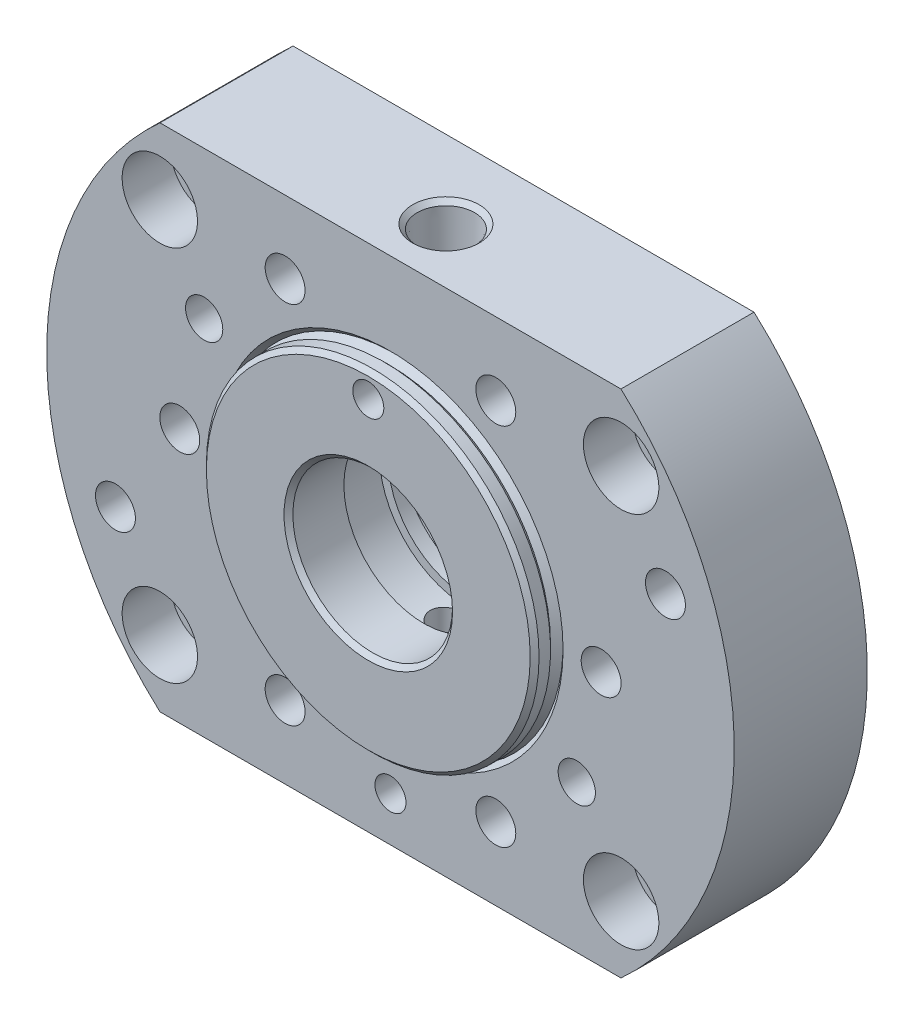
from build123d import *

# Parameters (mm, degrees)
SKETCH_2_W               = 5
SKETCH_2_H               = 57.081863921
CUT_EXTRUDE_1_DEPTH      = 1
SKETCH_3_W               = 162.907791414
SKETCH_3_H               = 39.12352471
CUT_EXTRUDE_3_DEPTH      = 116.05433499
CUT_EXTRUDE_4_REACH      = 104.652
CUT_EXTRUDE_4_END_RADIUS = 5
SKETCH_5_R               = 3.5
SKETCH_8_R               = 4.5
CUT_EXTRUDE_7_DEPTH      = 103.652325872
SKETCH_9_R               = 7
CUT_EXTRUDE_8_DEPTH      = 9
PATTERN_CIRCULAR_1_COUNT = 6
SKETCH_11_R              = 5.5
CUT_EXTRUDE_9_DEPTH      = 103.652325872
SKETCH_12_R              = 8.5
CUT_EXTRUDE_10_DEPTH     = 11
CHAMFER_1_SIZE           = 1
CHAMFER_2_SIZE           = 1
CHAMFER_2_SIZE2          = 1.032761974


with BuildPart() as part:
    # Sketch 1 → Revolve 1 (revolve)
    with BuildSketch(Plane(origin=(0, 0, 0), x_dir=(0, 0, -1), z_dir=(1, 0, 0)), mode=Mode.PRIVATE) as revolve_1_sk:
        Polygon((-1, 18), (-1, 35), (0, 35), (0, 77.5), (-30, 77.5), (-30, 38.914213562), (-28.939339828, 37.853553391), (-30.353553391, 36.439339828), (-31.414213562, 37.5), (-35, 37.5), (-35, 18), (-22.5, 18), (-22.5, 20), (-12.5, 20), (-12.5, 18), (-9.3, 18), (-9.3, 21), (-4.5, 21), (-4.5, 18), align=None)
    revolve(revolve_1_sk.sketch.rotate(Axis((0, 0, 0), (0, 0, 1)), 90), axis=Axis((0, 0, 0), (0, 0, 1)))

    # Sketch 2 → Cut-Extrude 1 (cut)
    with BuildSketch(Plane(origin=(0, 0, 0), x_dir=(-1, 0, 0), z_dir=(0, 0, -1))):
        with Locations((0, -56.280152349)):
            Rectangle(SKETCH_2_W, SKETCH_2_H)
    extrude(amount=-CUT_EXTRUDE_1_DEPTH, mode=Mode.SUBTRACT)

    # Sketch 3 → Cut-Extrude 3 (cut, through all)
    with BuildSketch(Plane.XY):
        with Locations((-14.591150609, 77.061762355)):
            Rectangle(SKETCH_3_W, SKETCH_3_H)
        with Locations((-14.591150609, -77.061762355)):
            Rectangle(SKETCH_3_W, SKETCH_3_H)
    extrude(amount=CUT_EXTRUDE_3_DEPTH, mode=Mode.SUBTRACT)

    # Sketch 4 → NPT1_4 (revolve, cut)
    with BuildSketch(Plane(origin=(0, 0, 0), x_dir=(0, 0, -1), z_dir=(1, 0, 0)), mode=Mode.PRIVATE) as npt1_4_sk:
        Polygon((-12.5, 25.5), (-12.5, 42.5), (-11.46875, 42.5), (-11, 57.5), (-17.5, 57.5), (-17.5, -47.5), (-14, -47.5), (-14, 24.633974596), align=None)
    revolve(npt1_4_sk.sketch.rotate(Axis((0, 70.558895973, 17.5), (0, -1, 0)), 180), axis=Axis((0, 70.558895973, 17.5), (0, -1, 0)), mode=Mode.SUBTRACT)

    # Cut-Extrude 4: up to this cylinder (the profile starts outside it)
    cut_extrude_4_end = Plane(origin=(0, 32, 17.5), z_dir=(0, 1, 0)) * Cylinder(CUT_EXTRUDE_4_END_RADIUS, 220.304, mode=Mode.PRIVATE)
    # Sketch 5 → Cut-Extrude 4 (cut, up to the surface)
    with BuildSketch(Plane.XY.offset(35), mode=Mode.PRIVATE) as cut_extrude_4_sk1:
        with Locations((0, 32)):
            Circle(SKETCH_5_R)
    cut_extrude_4_tool1 = extrude(cut_extrude_4_sk1.sketch, amount=-CUT_EXTRUDE_4_REACH, mode=Mode.PRIVATE) - cut_extrude_4_end
    add(cut_extrude_4_tool1.solids().sort_by_distance((0, 32, 35))[0], mode=Mode.SUBTRACT)

    # Sketch 8 → Cut-Extrude 7 (cut, through all)
    with BuildSketch(Plane(origin=(0, 0, 0), x_dir=(-1, 0, 0), z_dir=(0, 0, -1))):
        with Locations((-47.5, 0)):
            Circle(SKETCH_8_R)
    cut_extrude_7 = extrude(amount=-CUT_EXTRUDE_7_DEPTH, mode=Mode.SUBTRACT)

    # Sketch 9 → Cut-Extrude 8 (cut)
    with BuildSketch(Plane.XY):
        with Locations((47.5, 0)):
            Circle(SKETCH_9_R)
    cut_extrude_8 = extrude(amount=CUT_EXTRUDE_8_DEPTH, mode=Mode.SUBTRACT)

    # Pattern Circular 1: Cut-Extrude 7, Cut-Extrude 8 ×6 about axis
    pattern_circular_1_axis = Axis((0, 0, 0), (0, 0, 1))
    add([cut_extrude_7.rotate(pattern_circular_1_axis, i * 360 / PATTERN_CIRCULAR_1_COUNT) for i in range(1, PATTERN_CIRCULAR_1_COUNT)], mode=Mode.SUBTRACT)
    add([cut_extrude_8.rotate(pattern_circular_1_axis, i * 360 / PATTERN_CIRCULAR_1_COUNT) for i in range(1, PATTERN_CIRCULAR_1_COUNT)], mode=Mode.SUBTRACT)

    # Sketch 11 → Cut-Extrude 9 (cut, through all)
    with BuildSketch(Plane(origin=(0, 0, 0), x_dir=(-1, 0, 0), z_dir=(0, 0, -1))):
        with Locations((52, 42.5)):
            Circle(SKETCH_11_R)
        with Locations((-52, 42.5)):
            Circle(SKETCH_11_R)
        with Locations((-52, -42.5)):
            Circle(SKETCH_11_R)
        with Locations((52, -42.5)):
            Circle(SKETCH_11_R)
    extrude(amount=-CUT_EXTRUDE_9_DEPTH, mode=Mode.SUBTRACT)

    # Sketch 12 → Cut-Extrude 10 (cut)
    with BuildSketch(Plane(origin=(0, 0, 30), x_dir=(-1, 0, 0), z_dir=(0, 0, -1))):
        with Locations((52, 42.5)):
            Circle(SKETCH_12_R)
        with Locations((-52, 42.5)):
            Circle(SKETCH_12_R)
        with Locations((-52, -42.5)):
            Circle(SKETCH_12_R)
        with Locations((52, -42.5)):
            Circle(SKETCH_12_R)
    extrude(amount=CUT_EXTRUDE_10_DEPTH, mode=Mode.SUBTRACT)

    # Chamfer 1
    chamfer_1_edges = [part.edges().sort_by_distance(p)[0] for p in [
        (18, 0, 35),
        (37.5, 0, 35),
        (18, 0, 1),
    ]]
    chamfer(chamfer_1_edges, length=CHAMFER_1_SIZE)

    # Sketch 15 → Cut-Revolve 1 (revolve, cut)
    with BuildSketch(Plane(origin=(0, 0, 0), x_dir=(0, 0, -1), z_dir=(1, 0, 0)), mode=Mode.PRIVATE) as cut_revolve_1_sk:
        Polygon((-30, -51), (-13, -51), (-10.979274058, -47.5), (-30, -47.5), align=None)
    revolve(cut_revolve_1_sk.sketch.rotate(Axis((0, -47.5, 30), (0, 0, 1)), 180), axis=Axis((0, -47.5, 30), (0, 0, 1)), mode=Mode.SUBTRACT)

    # Sketch 16 → Cut-Revolve 2 (revolve, cut)
    with BuildSketch(Plane(origin=(0, 24.25, 0), x_dir=(-1, 0, 0), z_dir=(0, 1, 0)), mode=Mode.PRIVATE) as cut_revolve_2_sk:
        Polygon((42.002232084, 0), (46.502232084, 0), (46.202232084, 30), (42.002232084, 30), align=None)
    revolve(cut_revolve_2_sk.sketch.rotate(Axis((-42.002232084, 24.25, 30), (0, 0, -1)), 180), axis=Axis((-42.002232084, 24.25, 30), (0, 0, -1)), mode=Mode.SUBTRACT)

    # Sketch 17 → Cut-Revolve 3 (revolve, cut)
    with BuildSketch(Plane(origin=(0, -24.25, 0), x_dir=(-1, 0, 0), z_dir=(0, 1, 0))):
        Polygon((-42.002232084, 0), (-46.502232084, 0), (-46.202232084, 30), (-42.002232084, 30), align=None)
    revolve(axis=Axis((42.002232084, -24.25, 30), (0, 0, -1)), mode=Mode.SUBTRACT)

    # Sketch 19 → Cut-Revolve 4 (revolve, cut)
    with BuildSketch(Plane(origin=(0, -22.5, 0), x_dir=(-1, 0, 0), z_dir=(0, 1, 0)), mode=Mode.PRIVATE) as cut_revolve_4_sk:
        Polygon((62, 30), (66.5, 30), (66.2, 0), (62, 0), align=None)
    revolve(cut_revolve_4_sk.sketch.rotate(Axis((-62, -22.5, 30), (0, 0, -1)), 180), axis=Axis((-62, -22.5, 30), (0, 0, -1)), mode=Mode.SUBTRACT)

    # Sketch 20 → Cut-Revolve 5 (revolve, cut)
    with BuildSketch(Plane(origin=(0, 22.5, 0), x_dir=(-1, 0, 0), z_dir=(0, 1, 0)), mode=Mode.PRIVATE) as cut_revolve_5_sk:
        Polygon((-62, 30), (-66.5, 30), (-66.2, 0), (-62, 0), align=None)
    revolve(cut_revolve_5_sk.sketch.rotate(Axis((62, 22.5, 30), (0, 0, 1)), 180), axis=Axis((62, 22.5, 30), (0, 0, 1)), mode=Mode.SUBTRACT)

    # Chamfer 2
    chamfer_2_edges = [part.edges().sort_by_distance(p)[0] for p in [
        (0, 57.5, 11),
    ]]
    chamfer_2_side = [part.faces().sort_by_distance(p)[0] for p in [
        (0, 57.5, 1.081665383),
    ]]
    chamfer(chamfer_2_edges, length=CHAMFER_2_SIZE, length2=CHAMFER_2_SIZE2, reference=chamfer_2_side[0])


solid = part.part
